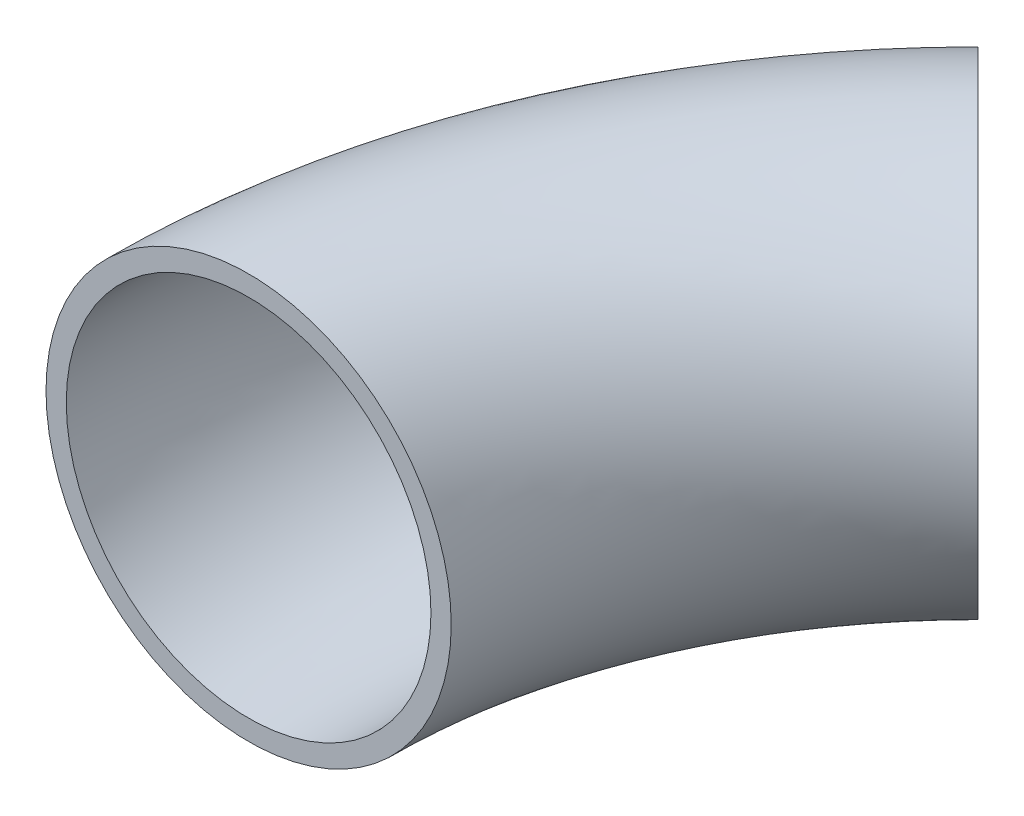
ISO-10303-21;
HEADER;
FILE_DESCRIPTION(('STEP AP214'),'2;1');
FILE_NAME('part.step','',(''),(''),'','','');
FILE_SCHEMA(('AUTOMOTIVE_DESIGN { 1 0 10303 214 1 1 1 1 }'));
ENDSEC;
DATA;
#1=APPLICATION_CONTEXT('core data for automotive mechanical design processes');
#2=APPLICATION_PROTOCOL_DEFINITION('international standard','automotive_design',2000,#1);
#3=PRODUCT_CONTEXT('',#1,'mechanical');
#4=PRODUCT('Part','Part','',(#3));
#5=PRODUCT_RELATED_PRODUCT_CATEGORY('part','',(#4));
#6=PRODUCT_DEFINITION_FORMATION('','',#4);
#7=PRODUCT_DEFINITION_CONTEXT('part definition',#1,'design');
#8=PRODUCT_DEFINITION('design','',#6,#7);
#9=PRODUCT_DEFINITION_SHAPE('','',#8);
#10=(LENGTH_UNIT() NAMED_UNIT(*) SI_UNIT(.MILLI.,.METRE.));
#11=(NAMED_UNIT(*) PLANE_ANGLE_UNIT() SI_UNIT($,.RADIAN.));
#12=(NAMED_UNIT(*) SI_UNIT($,.STERADIAN.) SOLID_ANGLE_UNIT());
#13=UNCERTAINTY_MEASURE_WITH_UNIT(LENGTH_MEASURE(1.E-05),#10,'distance_accuracy_value','');
#14=(GEOMETRIC_REPRESENTATION_CONTEXT(3) GLOBAL_UNCERTAINTY_ASSIGNED_CONTEXT((#13)) GLOBAL_UNIT_ASSIGNED_CONTEXT((#10,
#11,#12)) REPRESENTATION_CONTEXT('',''));
#15=CARTESIAN_POINT('',(0.,0.,0.));
#16=DIRECTION('',(0.,0.,1.));
#17=DIRECTION('',(1.,0.,0.));
#18=AXIS2_PLACEMENT_3D('',#15,#16,#17);
#19=CARTESIAN_POINT('',(54.,0.,0.));
#20=DIRECTION('',(0.,1.,0.));
#21=DIRECTION('',(0.,0.,1.));
#22=AXIS2_PLACEMENT_3D('',#19,#20,#21);
#23=TOROIDAL_SURFACE('',#22,54.,15.);
#24=CARTESIAN_POINT('',(15.8162338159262,0.,-38.1837661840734));
#25=DIRECTION('',(-0.707106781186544,0.,0.707106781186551));
#26=DIRECTION('',(0.707106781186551,0.,0.707106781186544));
#27=AXIS2_PLACEMENT_3D('',#24,#25,#26);
#28=CIRCLE('',#27,15.);
#29=CARTESIAN_POINT('',(5.20963209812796,0.,-48.7903679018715));
#30=VERTEX_POINT('',#29);
#31=EDGE_CURVE('E10',#30,#30,#28,.T.);
#32=CARTESIAN_POINT('',(0.,0.,0.));
#33=DIRECTION('',(0.,0.,1.));
#34=DIRECTION('',(1.,0.,0.));
#35=AXIS2_PLACEMENT_3D('',#32,#33,#34);
#36=CIRCLE('',#35,15.);
#37=CARTESIAN_POINT('',(-15.,0.,0.));
#38=VERTEX_POINT('',#37);
#39=EDGE_CURVE('E34',#38,#38,#36,.T.);
#40=CARTESIAN_POINT('',(54.,0.,0.));
#41=DIRECTION('',(0.,1.,0.));
#42=DIRECTION('',(0.,0.,1.));
#43=AXIS2_PLACEMENT_3D('',#40,#41,#42);
#44=CIRCLE('',#43,69.);
#45=EDGE_CURVE('',#30,#38,#44,.T.);
#46=ORIENTED_EDGE('',*,*,#31,.T.);
#47=ORIENTED_EDGE('',*,*,#39,.F.);
#48=ORIENTED_EDGE('',*,*,#45,.T.);
#49=ORIENTED_EDGE('',*,*,#45,.F.);
#50=EDGE_LOOP('',(#46,#48,#47,#49));
#51=FACE_BOUND('',#50,.T.);
#52=ADVANCED_FACE('F28',(#51),#23,.T.);
#53=CARTESIAN_POINT('',(15.8162338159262,0.,-38.1837661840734));
#54=DIRECTION('',(-0.707106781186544,0.,0.707106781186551));
#55=DIRECTION('',(0.707106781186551,0.,0.707106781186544));
#56=AXIS2_PLACEMENT_3D('',#53,#54,#55);
#57=PLANE('',#56);
#58=CARTESIAN_POINT('',(15.8162338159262,0.,-38.1837661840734));
#59=DIRECTION('',(-0.707106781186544,0.,0.707106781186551));
#60=DIRECTION('',(0.707106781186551,0.,0.707106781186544));
#61=AXIS2_PLACEMENT_3D('',#58,#59,#60);
#62=CIRCLE('',#61,13.5);
#63=CARTESIAN_POINT('',(6.27029226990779,0.,-47.7297077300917));
#64=VERTEX_POINT('',#63);
#65=EDGE_CURVE('E38',#64,#64,#62,.T.);
#66=ORIENTED_EDGE('',*,*,#65,.T.);
#67=EDGE_LOOP('',(#66));
#68=FACE_BOUND('',#67,.T.);
#69=ORIENTED_EDGE('',*,*,#31,.F.);
#70=EDGE_LOOP('',(#69));
#71=FACE_BOUND('',#70,.T.);
#72=ADVANCED_FACE('F52',(#68,#71),#57,.F.);
#73=CARTESIAN_POINT('',(0.,0.,0.));
#74=DIRECTION('',(0.,0.,1.));
#75=DIRECTION('',(1.,0.,0.));
#76=AXIS2_PLACEMENT_3D('',#73,#74,#75);
#77=PLANE('',#76);
#78=CARTESIAN_POINT('',(0.,0.,0.));
#79=DIRECTION('',(0.,0.,1.));
#80=DIRECTION('',(1.,0.,0.));
#81=AXIS2_PLACEMENT_3D('',#78,#79,#80);
#82=CIRCLE('',#81,13.5);
#83=CARTESIAN_POINT('',(-13.5,0.,0.));
#84=VERTEX_POINT('',#83);
#85=EDGE_CURVE('E42',#84,#84,#82,.T.);
#86=ORIENTED_EDGE('',*,*,#85,.F.);
#87=EDGE_LOOP('',(#86));
#88=FACE_BOUND('',#87,.T.);
#89=ORIENTED_EDGE('',*,*,#39,.T.);
#90=EDGE_LOOP('',(#89));
#91=FACE_BOUND('',#90,.T.);
#92=ADVANCED_FACE('F50',(#88,#91),#77,.T.);
#93=CARTESIAN_POINT('',(54.,0.,0.));
#94=DIRECTION('',(0.,1.,0.));
#95=DIRECTION('',(0.,0.,1.));
#96=AXIS2_PLACEMENT_3D('',#93,#94,#95);
#97=TOROIDAL_SURFACE('',#96,54.,13.5);
#98=CARTESIAN_POINT('',(54.,0.,0.));
#99=DIRECTION('',(0.,1.,0.));
#100=DIRECTION('',(0.,0.,1.));
#101=AXIS2_PLACEMENT_3D('',#98,#99,#100);
#102=CIRCLE('',#101,67.5);
#103=EDGE_CURVE('',#64,#84,#102,.T.);
#104=ORIENTED_EDGE('',*,*,#65,.F.);
#105=ORIENTED_EDGE('',*,*,#85,.T.);
#106=ORIENTED_EDGE('',*,*,#103,.T.);
#107=ORIENTED_EDGE('',*,*,#103,.F.);
#108=EDGE_LOOP('',(#104,#106,#105,#107));
#109=FACE_BOUND('',#108,.T.);
#110=ADVANCED_FACE('F48',(#109),#97,.F.);
#111=CLOSED_SHELL('',(#52,#72,#92,#110));
#112=MANIFOLD_SOLID_BREP('B2',#111);
#113=ADVANCED_BREP_SHAPE_REPRESENTATION('',(#18,#112),#14);
#114=SHAPE_DEFINITION_REPRESENTATION(#9,#113);
ENDSEC;
END-ISO-10303-21;
